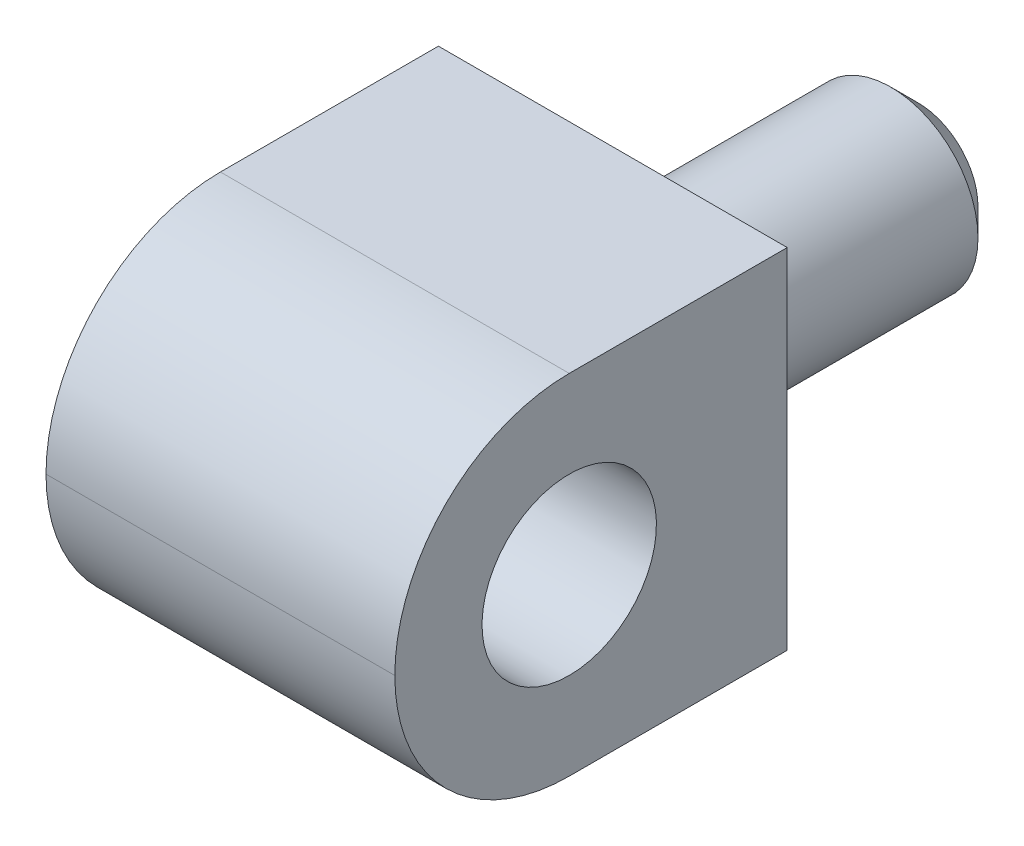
ISO-10303-21;
HEADER;
FILE_DESCRIPTION(('STEP AP214'),'2;1');
FILE_NAME('part.step','',(''),(''),'','','');
FILE_SCHEMA(('AUTOMOTIVE_DESIGN { 1 0 10303 214 1 1 1 1 }'));
ENDSEC;
DATA;
#1=APPLICATION_CONTEXT('core data for automotive mechanical design processes');
#2=APPLICATION_PROTOCOL_DEFINITION('international standard','automotive_design',2000,#1);
#3=PRODUCT_CONTEXT('',#1,'mechanical');
#4=PRODUCT('Part','Part','',(#3));
#5=PRODUCT_RELATED_PRODUCT_CATEGORY('part','',(#4));
#6=PRODUCT_DEFINITION_FORMATION('','',#4);
#7=PRODUCT_DEFINITION_CONTEXT('part definition',#1,'design');
#8=PRODUCT_DEFINITION('design','',#6,#7);
#9=PRODUCT_DEFINITION_SHAPE('','',#8);
#10=(LENGTH_UNIT() NAMED_UNIT(*) SI_UNIT(.MILLI.,.METRE.));
#11=(NAMED_UNIT(*) PLANE_ANGLE_UNIT() SI_UNIT($,.RADIAN.));
#12=(NAMED_UNIT(*) SI_UNIT($,.STERADIAN.) SOLID_ANGLE_UNIT());
#13=UNCERTAINTY_MEASURE_WITH_UNIT(LENGTH_MEASURE(1.E-05),#10,'distance_accuracy_value','');
#14=(GEOMETRIC_REPRESENTATION_CONTEXT(3) GLOBAL_UNCERTAINTY_ASSIGNED_CONTEXT((#13)) GLOBAL_UNIT_ASSIGNED_CONTEXT((#10,
#11,#12)) REPRESENTATION_CONTEXT('',''));
#15=CARTESIAN_POINT('',(0.,0.,0.));
#16=DIRECTION('',(0.,0.,1.));
#17=DIRECTION('',(1.,0.,0.));
#18=AXIS2_PLACEMENT_3D('',#15,#16,#17);
#19=CARTESIAN_POINT('',(8.,-8.,18.));
#20=DIRECTION('',(-1.,0.,0.));
#21=DIRECTION('',(0.,1.,0.));
#22=AXIS2_PLACEMENT_3D('',#19,#20,#21);
#23=PLANE('',#22);
#24=CARTESIAN_POINT('',(8.,0.,10.));
#25=DIRECTION('',(1.,0.,0.));
#26=DIRECTION('',(0.,-1.,0.));
#27=AXIS2_PLACEMENT_3D('',#24,#25,#26);
#28=CIRCLE('',#27,4.);
#29=CARTESIAN_POINT('',(8.,-4.,10.));
#30=VERTEX_POINT('',#29);
#31=EDGE_CURVE('E166',#30,#30,#28,.T.);
#32=ORIENTED_EDGE('',*,*,#31,.F.);
#33=EDGE_LOOP('',(#32));
#34=FACE_BOUND('',#33,.T.);
#35=CARTESIAN_POINT('',(8.,0.,10.));
#36=DIRECTION('',(-1.,0.,0.));
#37=DIRECTION('',(0.,1.,0.));
#38=AXIS2_PLACEMENT_3D('',#35,#36,#37);
#39=CIRCLE('',#38,8.);
#40=CARTESIAN_POINT('',(8.,8.,10.));
#41=VERTEX_POINT('',#40);
#42=CARTESIAN_POINT('',(8.,0.,18.));
#43=VERTEX_POINT('',#42);
#44=EDGE_CURVE('E29',#41,#43,#39,.F.);
#45=ORIENTED_EDGE('',*,*,#44,.T.);
#46=CARTESIAN_POINT('',(8.,0.,10.));
#47=DIRECTION('',(-1.,0.,0.));
#48=DIRECTION('',(0.,1.,0.));
#49=AXIS2_PLACEMENT_3D('',#46,#47,#48);
#50=CIRCLE('',#49,8.);
#51=CARTESIAN_POINT('',(8.,-8.,10.));
#52=VERTEX_POINT('',#51);
#53=EDGE_CURVE('E99',#43,#52,#50,.F.);
#54=ORIENTED_EDGE('',*,*,#53,.T.);
#55=DIRECTION('',(0.,0.,-1.));
#56=VECTOR('',#55,1.);
#57=CARTESIAN_POINT('',(8.,-8.,18.));
#58=LINE('',#57,#56);
#59=CARTESIAN_POINT('',(8.,-8.,0.));
#60=VERTEX_POINT('',#59);
#61=EDGE_CURVE('E72',#52,#60,#58,.T.);
#62=ORIENTED_EDGE('',*,*,#61,.T.);
#63=DIRECTION('',(0.,1.,0.));
#64=VECTOR('',#63,1.);
#65=CARTESIAN_POINT('',(8.,-8.,0.));
#66=LINE('',#65,#64);
#67=CARTESIAN_POINT('',(8.,8.,0.));
#68=VERTEX_POINT('',#67);
#69=EDGE_CURVE('E70',#60,#68,#66,.T.);
#70=ORIENTED_EDGE('',*,*,#69,.T.);
#71=DIRECTION('',(0.,0.,-1.));
#72=VECTOR('',#71,1.);
#73=CARTESIAN_POINT('',(8.,8.,18.));
#74=LINE('',#73,#72);
#75=EDGE_CURVE('E60',#41,#68,#74,.T.);
#76=ORIENTED_EDGE('',*,*,#75,.F.);
#77=EDGE_LOOP('',(#45,#54,#62,#70,#76));
#78=FACE_BOUND('',#77,.T.);
#79=ADVANCED_FACE('F14',(#34,#78),#23,.F.);
#80=CARTESIAN_POINT('',(-8.,8.,18.));
#81=DIRECTION('',(0.,1.,0.));
#82=DIRECTION('',(1.,0.,0.));
#83=AXIS2_PLACEMENT_3D('',#80,#81,#82);
#84=PLANE('',#83);
#85=DIRECTION('',(0.,0.,-1.));
#86=VECTOR('',#85,1.);
#87=CARTESIAN_POINT('',(-8.,8.,18.));
#88=LINE('',#87,#86);
#89=CARTESIAN_POINT('',(-8.,8.,10.));
#90=VERTEX_POINT('',#89);
#91=CARTESIAN_POINT('',(-8.,8.,0.));
#92=VERTEX_POINT('',#91);
#93=EDGE_CURVE('E67',#90,#92,#88,.T.);
#94=ORIENTED_EDGE('',*,*,#93,.F.);
#95=DIRECTION('',(1.,0.,0.));
#96=VECTOR('',#95,1.);
#97=CARTESIAN_POINT('',(-8.,8.,10.));
#98=LINE('',#97,#96);
#99=EDGE_CURVE('E37',#90,#41,#98,.T.);
#100=ORIENTED_EDGE('',*,*,#99,.T.);
#101=ORIENTED_EDGE('',*,*,#75,.T.);
#102=DIRECTION('',(1.,0.,0.));
#103=VECTOR('',#102,1.);
#104=CARTESIAN_POINT('',(-8.,8.,0.));
#105=LINE('',#104,#103);
#106=EDGE_CURVE('E64',#92,#68,#105,.T.);
#107=ORIENTED_EDGE('',*,*,#106,.F.);
#108=EDGE_LOOP('',(#94,#100,#101,#107));
#109=FACE_BOUND('',#108,.T.);
#110=ADVANCED_FACE('F62',(#109),#84,.T.);
#111=CARTESIAN_POINT('',(-8.,8.,18.));
#112=DIRECTION('',(1.,0.,0.));
#113=DIRECTION('',(0.,0.,1.));
#114=AXIS2_PLACEMENT_3D('',#111,#112,#113);
#115=PLANE('',#114);
#116=DIRECTION('',(0.,0.,-1.));
#117=VECTOR('',#116,1.);
#118=CARTESIAN_POINT('',(-8.,-8.,18.));
#119=LINE('',#118,#117);
#120=CARTESIAN_POINT('',(-8.,-8.,10.));
#121=VERTEX_POINT('',#120);
#122=CARTESIAN_POINT('',(-8.,-8.,0.));
#123=VERTEX_POINT('',#122);
#124=EDGE_CURVE('E89',#121,#123,#119,.T.);
#125=ORIENTED_EDGE('',*,*,#124,.F.);
#126=CARTESIAN_POINT('',(-8.,0.,10.));
#127=DIRECTION('',(1.,0.,0.));
#128=DIRECTION('',(0.,0.,1.));
#129=AXIS2_PLACEMENT_3D('',#126,#127,#128);
#130=CIRCLE('',#129,8.);
#131=CARTESIAN_POINT('',(-8.,0.,18.));
#132=VERTEX_POINT('',#131);
#133=EDGE_CURVE('E96',#121,#132,#130,.F.);
#134=ORIENTED_EDGE('',*,*,#133,.T.);
#135=CARTESIAN_POINT('',(-8.,0.,10.));
#136=DIRECTION('',(1.,0.,0.));
#137=DIRECTION('',(0.,0.,1.));
#138=AXIS2_PLACEMENT_3D('',#135,#136,#137);
#139=CIRCLE('',#138,8.);
#140=EDGE_CURVE('E94',#132,#90,#139,.F.);
#141=ORIENTED_EDGE('',*,*,#140,.T.);
#142=ORIENTED_EDGE('',*,*,#93,.T.);
#143=DIRECTION('',(0.,-1.,0.));
#144=VECTOR('',#143,1.);
#145=CARTESIAN_POINT('',(-8.,8.,0.));
#146=LINE('',#145,#144);
#147=EDGE_CURVE('E81',#92,#123,#146,.T.);
#148=ORIENTED_EDGE('',*,*,#147,.T.);
#149=EDGE_LOOP('',(#125,#134,#141,#142,#148));
#150=FACE_BOUND('',#149,.T.);
#151=ADVANCED_FACE('F121',(#150),#115,.F.);
#152=CARTESIAN_POINT('',(8.,-8.,18.));
#153=DIRECTION('',(0.,-1.,0.));
#154=DIRECTION('',(0.,0.,-1.));
#155=AXIS2_PLACEMENT_3D('',#152,#153,#154);
#156=PLANE('',#155);
#157=ORIENTED_EDGE('',*,*,#61,.F.);
#158=DIRECTION('',(-1.,0.,0.));
#159=VECTOR('',#158,1.);
#160=CARTESIAN_POINT('',(8.,-8.,10.));
#161=LINE('',#160,#159);
#162=EDGE_CURVE('E66',#52,#121,#161,.T.);
#163=ORIENTED_EDGE('',*,*,#162,.T.);
#164=ORIENTED_EDGE('',*,*,#124,.T.);
#165=DIRECTION('',(-1.,0.,0.));
#166=VECTOR('',#165,1.);
#167=CARTESIAN_POINT('',(8.,-8.,0.));
#168=LINE('',#167,#166);
#169=EDGE_CURVE('E83',#60,#123,#168,.T.);
#170=ORIENTED_EDGE('',*,*,#169,.F.);
#171=EDGE_LOOP('',(#157,#163,#164,#170));
#172=FACE_BOUND('',#171,.T.);
#173=ADVANCED_FACE('F127',(#172),#156,.T.);
#174=CARTESIAN_POINT('',(8.,8.,0.));
#175=DIRECTION('',(0.,0.,-1.));
#176=DIRECTION('',(1.,0.,0.));
#177=AXIS2_PLACEMENT_3D('',#174,#175,#176);
#178=PLANE('',#177);
#179=ORIENTED_EDGE('',*,*,#69,.F.);
#180=ORIENTED_EDGE('',*,*,#169,.T.);
#181=ORIENTED_EDGE('',*,*,#147,.F.);
#182=ORIENTED_EDGE('',*,*,#106,.T.);
#183=EDGE_LOOP('',(#179,#180,#181,#182));
#184=FACE_BOUND('',#183,.T.);
#185=CARTESIAN_POINT('',(0.,0.,0.));
#186=DIRECTION('',(0.,0.,-1.));
#187=DIRECTION('',(1.,0.,0.));
#188=AXIS2_PLACEMENT_3D('',#185,#186,#187);
#189=CIRCLE('',#188,4.);
#190=CARTESIAN_POINT('',(4.,0.,0.));
#191=VERTEX_POINT('',#190);
#192=EDGE_CURVE('E171',#191,#191,#189,.T.);
#193=ORIENTED_EDGE('',*,*,#192,.F.);
#194=EDGE_LOOP('',(#193));
#195=FACE_BOUND('',#194,.T.);
#196=ADVANCED_FACE('F78',(#184,#195),#178,.T.);
#197=CARTESIAN_POINT('',(-8.,0.,10.));
#198=DIRECTION('',(-1.,0.,0.));
#199=DIRECTION('',(0.,1.,0.));
#200=AXIS2_PLACEMENT_3D('',#197,#198,#199);
#201=CYLINDRICAL_SURFACE('',#200,8.);
#202=DIRECTION('',(1.,0.,0.));
#203=VECTOR('',#202,1.);
#204=CARTESIAN_POINT('',(-8.,0.,18.));
#205=LINE('',#204,#203);
#206=EDGE_CURVE('E76',#43,#132,#205,.F.);
#207=ORIENTED_EDGE('',*,*,#206,.F.);
#208=ORIENTED_EDGE('',*,*,#44,.F.);
#209=ORIENTED_EDGE('',*,*,#99,.F.);
#210=ORIENTED_EDGE('',*,*,#140,.F.);
#211=EDGE_LOOP('',(#207,#208,#209,#210));
#212=FACE_BOUND('',#211,.T.);
#213=ADVANCED_FACE('F149',(#212),#201,.T.);
#214=CARTESIAN_POINT('',(8.,0.,10.));
#215=DIRECTION('',(1.,0.,0.));
#216=DIRECTION('',(0.,0.,1.));
#217=AXIS2_PLACEMENT_3D('',#214,#215,#216);
#218=CYLINDRICAL_SURFACE('',#217,8.);
#219=ORIENTED_EDGE('',*,*,#53,.F.);
#220=ORIENTED_EDGE('',*,*,#206,.T.);
#221=ORIENTED_EDGE('',*,*,#133,.F.);
#222=ORIENTED_EDGE('',*,*,#162,.F.);
#223=EDGE_LOOP('',(#219,#220,#221,#222));
#224=FACE_BOUND('',#223,.T.);
#225=ADVANCED_FACE('F142',(#224),#218,.T.);
#226=CARTESIAN_POINT('',(-5.,0.,10.));
#227=DIRECTION('',(1.,0.,0.));
#228=DIRECTION('',(0.,-1.,0.));
#229=AXIS2_PLACEMENT_3D('',#226,#227,#228);
#230=CYLINDRICAL_SURFACE('',#229,4.);
#231=CARTESIAN_POINT('',(-5.,0.,10.));
#232=DIRECTION('',(1.,0.,0.));
#233=DIRECTION('',(0.,-1.,0.));
#234=AXIS2_PLACEMENT_3D('',#231,#232,#233);
#235=CIRCLE('',#234,4.);
#236=CARTESIAN_POINT('',(-5.,-4.,10.));
#237=VERTEX_POINT('',#236);
#238=EDGE_CURVE('E162',#237,#237,#235,.T.);
#239=ORIENTED_EDGE('',*,*,#238,.F.);
#240=EDGE_LOOP('',(#239));
#241=FACE_BOUND('',#240,.T.);
#242=ORIENTED_EDGE('',*,*,#31,.T.);
#243=EDGE_LOOP('',(#242));
#244=FACE_BOUND('',#243,.T.);
#245=ADVANCED_FACE('F136',(#241,#244),#230,.F.);
#246=CARTESIAN_POINT('',(-5.,0.,10.));
#247=DIRECTION('',(1.,0.,0.));
#248=DIRECTION('',(0.,-1.,0.));
#249=AXIS2_PLACEMENT_3D('',#246,#247,#248);
#250=PLANE('',#249);
#251=ORIENTED_EDGE('',*,*,#238,.T.);
#252=EDGE_LOOP('',(#251));
#253=FACE_BOUND('',#252,.T.);
#254=ADVANCED_FACE('F135',(#253),#250,.T.);
#255=CARTESIAN_POINT('',(0.,0.,-14.));
#256=DIRECTION('',(0.,0.,-1.));
#257=DIRECTION('',(1.,0.,0.));
#258=AXIS2_PLACEMENT_3D('',#255,#256,#257);
#259=PLANE('',#258);
#260=CARTESIAN_POINT('',(0.,0.,-14.));
#261=DIRECTION('',(0.,0.,-1.));
#262=DIRECTION('',(1.,0.,0.));
#263=AXIS2_PLACEMENT_3D('',#260,#261,#262);
#264=CIRCLE('',#263,2.75);
#265=CARTESIAN_POINT('',(2.75,0.,-14.));
#266=VERTEX_POINT('',#265);
#267=EDGE_CURVE('E22',#266,#266,#264,.T.);
#268=ORIENTED_EDGE('',*,*,#267,.T.);
#269=EDGE_LOOP('',(#268));
#270=FACE_BOUND('',#269,.T.);
#271=ADVANCED_FACE('F104',(#270),#259,.T.);
#272=CARTESIAN_POINT('',(0.,0.,-14.));
#273=DIRECTION('',(0.,0.,1.));
#274=DIRECTION('',(-1.,0.,0.));
#275=AXIS2_PLACEMENT_3D('',#272,#273,#274);
#276=CYLINDRICAL_SURFACE('',#275,4.);
#277=CARTESIAN_POINT('',(0.,0.,-12.75));
#278=DIRECTION('',(0.,0.,-1.));
#279=DIRECTION('',(1.,0.,0.));
#280=AXIS2_PLACEMENT_3D('',#277,#278,#279);
#281=CIRCLE('',#280,4.);
#282=CARTESIAN_POINT('',(4.,0.,-12.75));
#283=VERTEX_POINT('',#282);
#284=EDGE_CURVE('E9',#283,#283,#281,.F.);
#285=ORIENTED_EDGE('',*,*,#284,.T.);
#286=EDGE_LOOP('',(#285));
#287=FACE_BOUND('',#286,.T.);
#288=ORIENTED_EDGE('',*,*,#192,.T.);
#289=EDGE_LOOP('',(#288));
#290=FACE_BOUND('',#289,.T.);
#291=ADVANCED_FACE('F107',(#287,#290),#276,.T.);
#292=CARTESIAN_POINT('',(0.,0.,-14.));
#293=DIRECTION('',(0.,0.,1.));
#294=DIRECTION('',(-1.,0.,0.));
#295=AXIS2_PLACEMENT_3D('',#292,#293,#294);
#296=CONICAL_SURFACE('',#295,2.75,0.785398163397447);
#297=ORIENTED_EDGE('',*,*,#284,.F.);
#298=EDGE_LOOP('',(#297));
#299=FACE_BOUND('',#298,.T.);
#300=ORIENTED_EDGE('',*,*,#267,.F.);
#301=EDGE_LOOP('',(#300));
#302=FACE_BOUND('',#301,.T.);
#303=ADVANCED_FACE('F16',(#299,#302),#296,.T.);
#304=CLOSED_SHELL('',(#79,#110,#151,#173,#196,#213,#225,#245,#254,#271,#291,#303));
#305=MANIFOLD_SOLID_BREP('B1',#304);
#306=ADVANCED_BREP_SHAPE_REPRESENTATION('',(#18,#305),#14);
#307=SHAPE_DEFINITION_REPRESENTATION(#9,#306);
ENDSEC;
END-ISO-10303-21;
